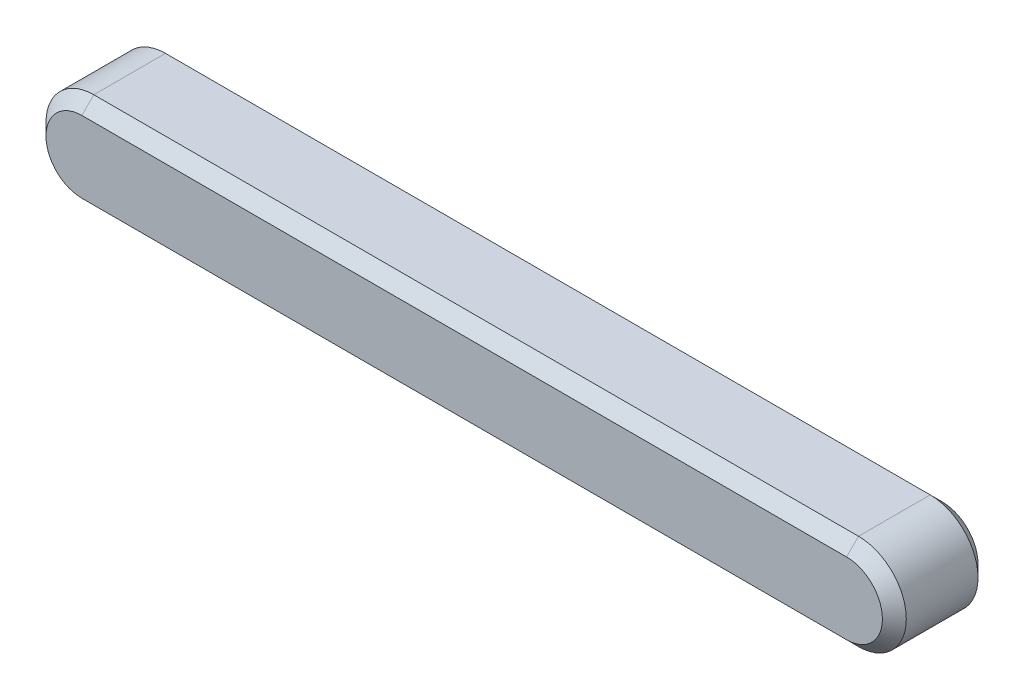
from build123d import *

# Parameters (mm, degrees)
EXTRUDE1_DEPTH = 2
CHAMFER1_SIZE  = 0.25


with BuildPart() as part:
    # body → Extrude1 (new body)
    with BuildSketch(Plane.XY):
        with BuildLine():
            Line((0, 0), (16, 0))
            ThreePointArc((16, 0), (17, 1), (16, 2))
            Line((16, 2), (0, 2))
            ThreePointArc((0, 2), (-1, 1), (0, 0))
        make_face()
    extrude(amount=EXTRUDE1_DEPTH)

    # Chamfer1
    chamfer1_edges = [part.edges().sort_by_distance(p)[0] for p in [
        (17, 1, 2),
        (8, 2, 2),
        (-1, 1, 2),
        (8, 2, 0),
        (17, 1, 0),
        (8, 0, 0),
        (-1, 1, 0),
        (8, 0, 2),
    ]]
    chamfer(chamfer1_edges, length=CHAMFER1_SIZE)


solid = part.part
